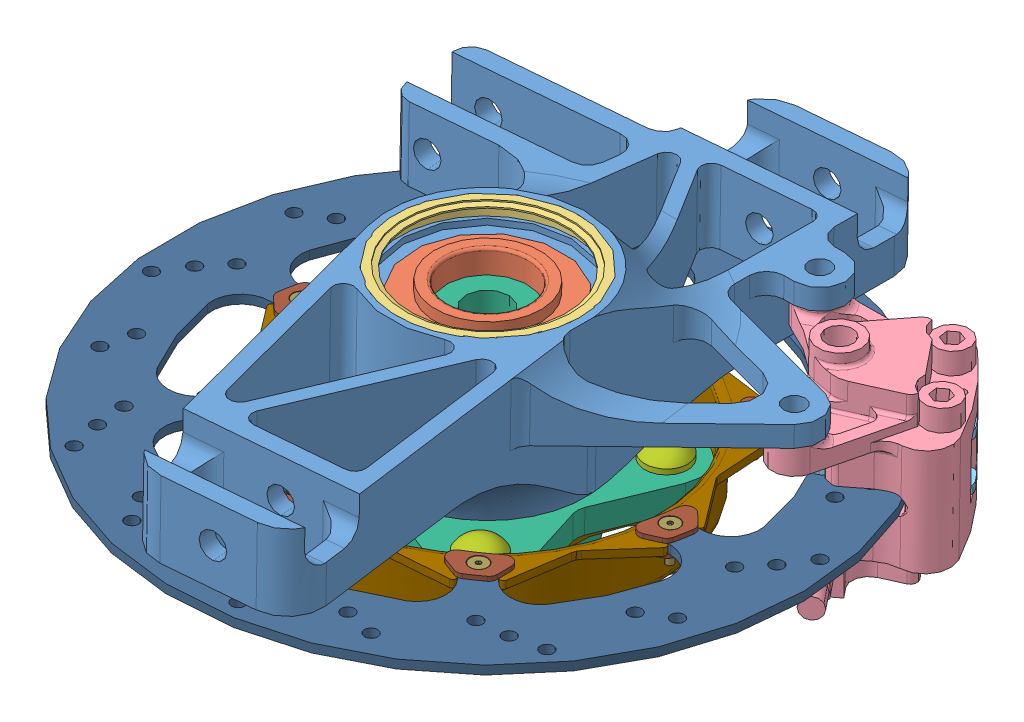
SolidWorks assembly brake assembly.SLDASM, configuration Default (file format 4400). Lengths in mm.
Overall size (327.79 106.32 327.79).
44 component instances, 12 part files, 8 mates.
Components (placement in the parent):
- Upright Assembly-1: Upright Assembly.SLDASM [Default] at (12.4715 -3.3376 -4.3135) size (187.69 75.94 260.67)
  - Upright-1: Upright.SLDPRT [AP Caliper] at (-28.1936 601.3602 -253.5794) size (187.69 75.94 260.67)
  - Tapered Roller Bearing-1: Tapered Roller Bearing.SLDPRT [Default] at (-28.1936 15.7273 0.3787) x (0 -0.999848 0.017452) z (0.983343 0.003172 0.181732) size (17 55 55)
  - Oil Seal-1: Oil Seal.SLDPRT [Default] at (-28.1936 -8.8942 0.8085) x (0 0.999848 -0.017452) z (-0.24266 0.016931 0.969964) size (6.35 67.59 67.59)
  - Tapered Roller Bearing-2: Tapered Roller Bearing.SLDPRT [Default] at (-28.1936 26.0254 0.199) x (0 0.999848 -0.017452) z (-0.594935 -0.014028 -0.803652) size (17 55 55)
  - Oil Seal-4: Oil Seal.SLDPRT [Default] at (-28.1936 47.6122 -0.1778) x (0 -0.999848 0.017452) z (-0.955056 0.005173 0.29638) size (6.35 67.59 67.59)
- Brake Caliper Assembly-1: Brake Caliper Assembly.SLDASM [Default] at (85.0145 -6.6208 -85.19) x (0.62932 0.013563 0.777028) z (0 0.999848 -0.017452) size (81.53 53.21 65.79)
  - Brake Caliper-2: Brake Caliper.SLDPRT [Default] at origin size (81.53 52.96 65.79)
  - Brake Pad-1: Brake Pad.SLDPRT [Default] at (0 -13.1318 -7.3025) size (39.75 43.48 7.11)
  - Brake Pad-2: Brake Pad.SLDPRT [Default] at (0 -13.1318 7.3025) x (-1 0 0) z (0 0 -1) size (39.75 43.48 7.11)
- Hub Assembly-1: Hub Assembly.SLDASM [Default] at (-15.7221 -24.6074 -3.289) x (0 -0.999848 0.017452) z (0.999633 0.000473 0.027101) size (81.66 92.75 92.75)
  - Hub - Aluminum-1: Hub - Aluminum.SLDPRT [SPLIT LINES] at (-63.5 0 0) size (68.33 92.75 92.75)
  - Wheel Stud-1: Wheel Stud.SLDPRT [LUG NUT CUT DOWN] at (-15.24 -33.676 33.676) x (1 0 0) z (0 0.091677 0.995789) size (41.27 15.88 15.88)
  - Wheel Stud-2: Wheel Stud.SLDPRT [LUG NUT CUT DOWN] at (-15.24 33.676 33.676) x (1 0 0) z (0 0.995789 -0.091677) size (41.27 15.88 15.88)
  - Wheel Stud-3: Wheel Stud.SLDPRT [LUG NUT CUT DOWN] at (-15.24 33.676 -33.676) x (1 0 0) z (0 -0.091677 -0.995789) size (41.27 15.88 15.88)
  - Wheel Stud-4: Wheel Stud.SLDPRT [LUG NUT CUT DOWN] at (-15.24 -33.676 -33.676) x (1 0 0) z (0 -0.995789 0.091677) size (41.27 15.88 15.88)
  - Hub Washer-1: Hub Washer.SLDPRT [NO_SPLITLINE] at (-20.0025 0 0) x (1 0 0) z (0 0.089607 0.995977) size (11.11 57.71 57.71)
- Brake Rotor Assembly-1: Brake Rotor Assembly.SLDASM [Default] at (7.0748 -37.6652 17.231) x (0 -0.999848 0.017452) z (0.726013 -0.012002 -0.687576) size (25.4 327.78 327.78)
  - Rotor Hat-1: Rotor Hat.SLDPRT [Default] at (-34.2242 30.4071 -2.5985) size (23.6 152.4 152.4)
  - Rotor-1: Rotor.SLDPRT [Default] at (-31.2397 30.4071 -2.5985) x (0 0.707107 0.707107) z (-1 0 0) size (231.78 231.78 3.17)
  - Rotor Washer-1: Rotor Washer.SLDPRT [Default] at (-31.2397 33.0101 -12.653) x (0 0.99948 0.032253) z (1 0 0) size (18.57 10.78 1.59)
  - Rotor Washer-27: Rotor Washer.SLDPRT [Chamfer] at (-34.4147 41.3596 -11.9484) x (0 -0.990749 -0.135705) z (-1 0 0) size (18.57 10.78 1.59)
  - Rotor Pin-6: Rotor Pin.SLDPRT [.5] at (-34.4534 30.4071 68.0135) x (0 0.996402 -0.084747) z (-1 0 0) size (6.36 6.36 12.79)
  - Rotor Washer-13: Rotor Washer.SLDPRT [Default] at (-31.2397 25.1381 -11.5488) x (0 0.729545 -0.683933) z (1 0 0) size (18.57 10.78 1.59)
  - Rotor Washer-14: Rotor Washer.SLDPRT [Default] at (-31.2397 20.3526 -5.2016) x (0 0.032253 -0.99948) z (1 0 0) size (18.57 10.78 1.59)
  - Rotor Washer-15: Rotor Washer.SLDPRT [Default] at (-31.2397 21.4568 2.6705) x (0 -0.683933 -0.729545) z (1 0 0) size (18.57 10.78 1.59)
  - Rotor Washer-16: Rotor Washer.SLDPRT [Default] at (-31.2397 27.804 7.456) x (0 -0.99948 -0.032253) z (1 0 0) size (18.57 10.78 1.59)
  - Rotor Washer-17: Rotor Washer.SLDPRT [Default] at (-31.2397 35.676 6.3518) x (0 -0.729545 0.683933) z (1 0 0) size (18.57 10.78 1.59)
  - Rotor Pin-7: Rotor Pin.SLDPRT [.5] at (-34.4534 80.3373 47.3317) x (0 0.644638 -0.764488) z (-1 0 0) size (6.36 6.36 12.79)
  - Rotor Pin-8: Rotor Pin.SLDPRT [.5] at (-34.4534 101.0191 -2.5985) x (0 -0.084747 -0.996402) z (-1 0 0) size (6.36 6.36 12.79)
  - Rotor Pin-9: Rotor Pin.SLDPRT [.5] at (-34.4534 80.3373 -52.5287) x (0 -0.764488 -0.644638) z (-1 0 0) size (6.36 6.36 12.79)
  - Rotor Pin-10: Rotor Pin.SLDPRT [.5] at (-34.4534 30.4071 -73.2105) x (0 -0.996402 0.084747) z (-1 0 0) size (6.36 6.36 12.79)
  - Rotor Pin-11: Rotor Pin.SLDPRT [.5] at (-34.4534 -19.5231 -52.5287) x (0 -0.644638 0.764488) z (-1 0 0) size (6.36 6.36 12.79)
  - Rotor Pin-12: Rotor Pin.SLDPRT [.5] at (-34.4534 -40.2049 -2.5985) x (0 0.084747 0.996402) z (-1 0 0) size (6.36 6.36 12.79)
  - Rotor Pin-13: Rotor Pin.SLDPRT [.5] at (-34.4534 -19.5231 47.3317) x (0 0.764488 0.644638) z (-1 0 0) size (6.36 6.36 12.79)
  - Rotor Washer-25: Rotor Washer.SLDPRT [Default] at (-31.2397 40.4616 0.0046) x (0 -0.032253 0.99948) z (1 0 0) size (18.57 10.78 1.59)
  - Rotor Washer-26: Rotor Washer.SLDPRT [Default] at (-31.2397 39.3573 -7.8675) x (0 0.683933 0.729545) z (1 0 0) size (18.57 10.78 1.59)
  - Rotor Washer-28: Rotor Washer.SLDPRT [Chamfer] at (-34.4147 31.5403 -16.9545) x (0 -0.796524 0.604608) z (-1 0 0) size (18.57 10.78 1.59)
  - Rotor Washer-29: Rotor Washer.SLDPRT [Chamfer] at (-34.4147 21.0572 -13.551) x (0 -0.135705 0.990749) z (-1 0 0) size (18.57 10.78 1.59)
  - Rotor Washer-30: Rotor Washer.SLDPRT [Chamfer] at (-34.4147 16.0511 -3.7317) x (0 0.604608 0.796524) z (-1 0 0) size (18.57 10.78 1.59)
  - Rotor Washer-31: Rotor Washer.SLDPRT [Chamfer] at (-34.4147 19.4545 6.7514) x (0 0.990749 0.135705) z (-1 0 0) size (18.57 10.78 1.59)
  - Rotor Washer-32: Rotor Washer.SLDPRT [Chamfer] at (-34.4147 29.2738 11.7575) x (0 0.796524 -0.604608) z (-1 0 0) size (18.57 10.78 1.59)
  - Rotor Washer-33: Rotor Washer.SLDPRT [Chamfer] at (-34.4147 39.757 8.3541) x (0 0.135705 -0.990749) z (-1 0 0) size (18.57 10.78 1.59)
  - Rotor Washer-34: Rotor Washer.SLDPRT [Chamfer] at (-34.4147 44.7631 -1.4652) x (0 -0.604608 -0.796524) z (-1 0 0) size (18.57 10.78 1.59)
Mates (geometry in assembly coordinates):
- Coincident5: coincident anti-aligned: plane of Upright Assembly-1/Upright-1 through (45.9406 21.3315 -9.0481) normal (0 -0.999848 0.017452); plane of Brake Caliper Assembly-1/Brake Caliper-2 through (29.9176 20.0544 -82.2148) normal (0 0.999848 -0.017452)
- Concentric1: concentric anti-aligned: cylinder of Upright Assembly-1/Upright-1 through (29.9173 54.6785 -82.8195) axis (0 -0.999848 0.017452) radius 4.0005; circle of Brake Caliper Assembly-1/Brake Caliper-2
- Concentric2: concentric anti-aligned: cylinder of Upright Assembly-1/Upright-1 through (70.1941 55.5465 -33.0894) axis (0 -0.999848 0.017452) radius 4.0005; circle of Brake Caliper Assembly-1/Brake Caliper-2
- Concentric3: concentric anti-aligned: cylinder of Upright Assembly-1/Tapered Roller Bearing-1 through (-15.7221 12.3897 -3.9348) axis (0 0.999848 -0.017452) radius 15; cylinder of Hub Assembly-1/Hub - Aluminum-1 through (-15.7221 -170.6838 -0.7392) axis (0 -0.999848 0.017452) radius 15
- Coincident7: coincident anti-aligned: plane of Hub Assembly-1/Hub - Aluminum-1 through (-14.001 -25.7152 -66.756) normal (0 -0.999848 0.017452); plane of Brake Rotor Assembly-1/Rotor Hat-1 through (-39.1907 -25.0398 -28.062) normal (0 0.999848 -0.017452)
- Concentric5: concentric anti-aligned: cylinder of Hub Assembly-1/Wheel Stud-2 through (18.8542 36.9139 -37.1186) axis (0 0.999848 -0.017452) radius 5.5563; cylinder of Brake Rotor Assembly-1/Rotor Hat-1 through (18.8542 -4.3709 -36.398) axis (0 -0.999848 0.017452) radius 5.5245
- Concentric6: concentric anti-aligned: cylinder of Hub Assembly-1/Hub - Aluminum-1 through (-15.7221 85.3927 -5.209) axis (0 0.999848 -0.017452) radius 31.75; circle of Brake Rotor Assembly-1/Rotor Hat-1
- Width1: width: plane of Brake Caliper Assembly-1/Brake Pad-2 through (61.1076 -3.5375 -86.8349) normal (0 -0.999848 0.017452); plane of Brake Caliper Assembly-1/Brake Pad-1 through (81.6 -9.3179 -61.4241) normal (0 0.999848 -0.017452); plane of Brake Rotor Assembly-1/Rotor-1 through (239.2781 -3.4892 3.2577) normal (0 0.999848 -0.017452); plane of Brake Rotor Assembly-1/Rotor-1 through (239.2781 -6.6637 3.3132) normal (0 -0.999848 0.017452); axis of ? through (-79.1805 17.5573 -2.9645) axis (1 0 0); sketch_entity of ?
